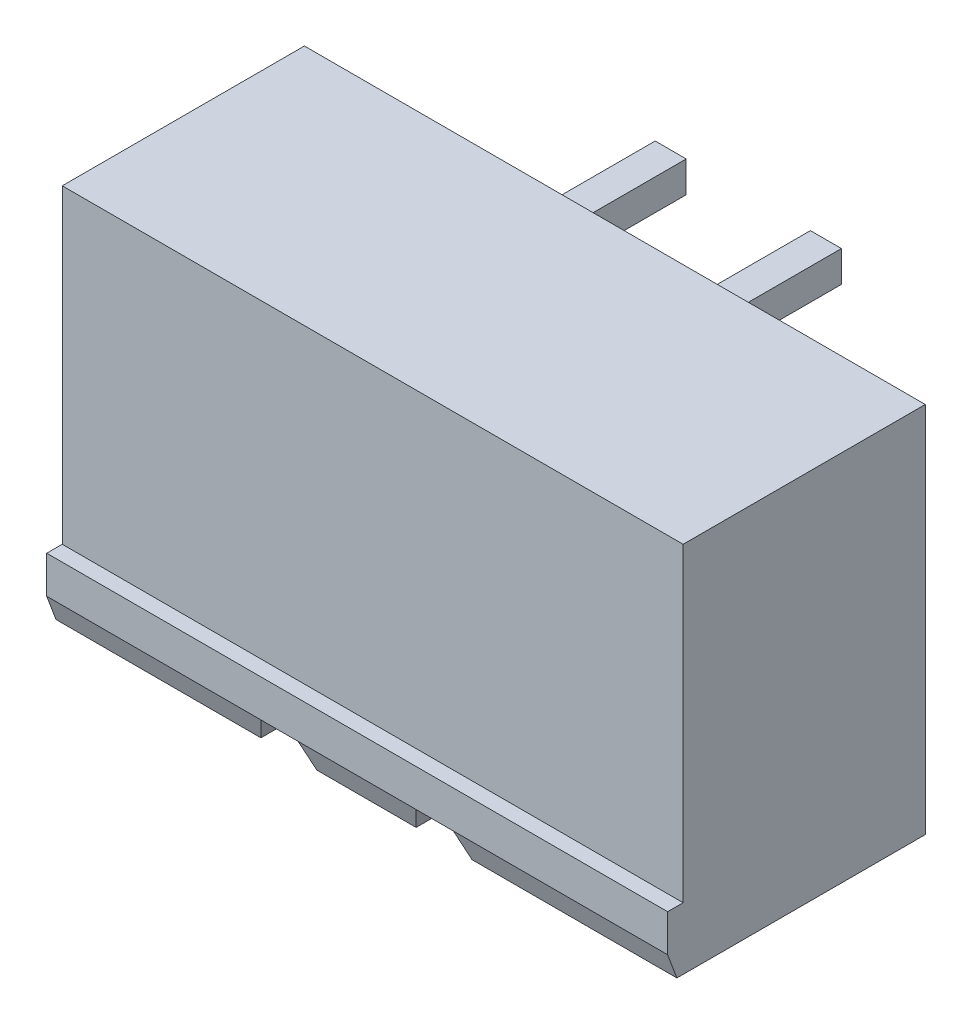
from build123d import *

# Parameters (mm, degrees)
SKETCH_1_W                         = 20
SKETCH_1_H                         = 8.3
EXTRUDE_1_DEPTH                    = 12
HOLE_WIZARD_M2_6_1_D               = 2.05
HOLE_WIZARD_M2_6_1_DEPTH           = 6.55
HOLE_WIZARD_M2_6_1_TIP             = 0.615882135
CUT_EXTRUDE_2_DEPTH                = 8
SKETCH_21_R                        = 1.5
EXTRUDE_2_DEPTH                    = 1.5
EXTRUDE_START                      = 2.5
EXTRUDE_1_2_DEPTH                  = 0.5
CHAMFER_3_SIZE                     = 0.2
PATTERN_LINEAR_1_COUNT             = 2
PATTERN_LINEAR_1_PITCH             = 5
CHAMFER_3_OF_PATTERN_LINEAR_1_SIZE = 0.2
SKETCH_7_W                         = 20
SKETCH_7_H                         = 10
CUT_EXTRUDE_4_DEPTH                = 0.5
CUT_EXTRUDE_7_DEPTH                = 25.824383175
CUT_EXTRUDE_8_REACH                = 22.195
MOVE_BODY_1_ANGLE                  = 90


with BuildPart() as part:
    # Sketch 1 → Extrude 1 (new body)
    with BuildSketch(Plane.XY):
        with Locations((0, 0.15)):
            Rectangle(SKETCH_1_W, SKETCH_1_H)
    extrude(amount=EXTRUDE_1_DEPTH)

    # Hole Wizard M2.6 _1
    with Locations(Plane.XY.offset(12)):
        with Locations((-7.5, 0), (7.5, 0)):
            Hole(HOLE_WIZARD_M2_6_1_D / 2, depth=HOLE_WIZARD_M2_6_1_DEPTH)
            with Locations((0, 0, -(HOLE_WIZARD_M2_6_1_DEPTH + HOLE_WIZARD_M2_6_1_TIP / 2))):  # 118° drill point
                Cone(0, HOLE_WIZARD_M2_6_1_D / 2, HOLE_WIZARD_M2_6_1_TIP, mode=Mode.SUBTRACT)

    # Sketch 3 → Cut-Extrude 2 (cut)
    with BuildSketch(Plane.XY.offset(12)):
        with BuildLine():
            Line((-5, 3), (5, 3))
            Line((5, 3), (5, -2.4))
            Line((5, -2.4), (4.124807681, -2.4))
            ThreePointArc((4.124807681, -2.4), (2.5, -3), (0.875192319, -2.4))
            Line((0.875192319, -2.4), (-0.875192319, -2.4))
            ThreePointArc((-0.875192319, -2.4), (-2.5, -3), (-4.124807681, -2.4))
            Line((-4.124807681, -2.4), (-5, -2.4))
            Line((-5, -2.4), (-5, 3))
        make_face()
    extrude(amount=-CUT_EXTRUDE_2_DEPTH, mode=Mode.SUBTRACT)

    # Sketch 21 → Extrude 2 (add)
    with BuildSketch(Plane.XY.offset(4)):
        with Locations((-2.5, 0)):
            Circle(SKETCH_21_R)
        with Locations(Location((2.5, 0, 0), (0, 0, 180))):
            Circle(SKETCH_21_R)
    extrude(amount=EXTRUDE_2_DEPTH)

    # Sketch 17 → Extrude 1 2 (add, symmetric)
    with BuildSketch(Plane(origin=(0, 0, 0), x_dir=(0, 0, -1), z_dir=(1, 0, 0)).offset(EXTRUDE_START)):
        with BuildLine():
            ThreePointArc((-2.1, 0.5), (-1.534314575, 0.265685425), (-1.3, -0.3))
            Line((-1.3, -0.3), (-1.3, -8.5))
            Line((-1.3, -8.5), (-2.3, -8.5))
            Line((-2.3, -8.5), (-2.3, -0.5))
            Line((-2.3, -0.5), (-11, -0.5))
            Line((-11, -0.5), (-11, 0.5))
            Line((-11, 0.5), (-2.1, 0.5))
        make_face()
    extrude_1_2 = extrude(amount=EXTRUDE_1_2_DEPTH, both=True)

    # Chamfer 3
    chamfer_3_edges = [part.edges().sort_by_distance(p)[0] for p in [
        (2.5, -8.5, 1.3),
        (2.5, -0.5, 11),
        (3, 0, 11),
        (2, -8.5, 1.8),
        (2, 0, 11),
        (2.5, 0.5, 11),
        (3, -8.5, 1.8),
        (2.5, -8.5, 2.3),
    ]]
    chamfer(chamfer_3_edges, length=CHAMFER_3_SIZE)

    # Pattern Linear 1: Extrude 1 2 ×2
    with Locations(*[(-i * PATTERN_LINEAR_1_PITCH, 0, 0) for i in range(1, PATTERN_LINEAR_1_COUNT)]):
        add(extrude_1_2)

    # Chamfer 3 of Pattern Linear 1
    chamfer_3_of_pattern_linear_1_edges = [part.edges().sort_by_distance(p)[0] for p in [
        (-2.5, -8.5, 1.3),
        (-2.5, -0.5, 11),
        (-2, 0, 11),
        (-3, -8.5, 1.8),
        (-3, 0, 11),
        (-2.5, 0.5, 11),
        (-2, -8.5, 1.8),
        (-2.5, -8.5, 2.3),
    ]]
    chamfer(chamfer_3_of_pattern_linear_1_edges, length=CHAMFER_3_OF_PATTERN_LINEAR_1_SIZE)

    # Sketch 7 → Cut-Extrude 4 (cut)
    with BuildSketch(Plane(origin=(0, 4.3, 0), x_dir=(1, 0, 0), z_dir=(0, 1, 0))):
        with Locations((0, -5)):
            Rectangle(SKETCH_7_W, SKETCH_7_H)
    extrude(amount=-CUT_EXTRUDE_4_DEPTH, mode=Mode.SUBTRACT)

    # Sketch 18 → Cut-Extrude 7 (cut, through all)
    with BuildSketch(Plane.ZY.offset(10)):
        Polygon((11.2, 4.3), (12, 4), (12, 4.3), align=None)
    extrude(amount=-CUT_EXTRUDE_7_DEPTH, mode=Mode.SUBTRACT)

    # Cut-Extrude 8: up to this face of the body (flat: up to its plane)
    cut_extrude_8_end = Plane(part.part.faces().sort_by_distance((0, 3, 8))[0])
    # Sketch 20 → Cut-Extrude 8 (cut, up to the picked face)
    with BuildSketch(Plane(origin=(0, 4.3, 0), x_dir=(1, 0, 0), z_dir=(0, 1, 0)), mode=Mode.PRIVATE) as cut_extrude_8_sk1:
        Polygon((3.4, -12), (3.1, -11.2), (1.9, -11.2), (1.6, -12), align=None)
    cut_extrude_8_tool1 = split(extrude(cut_extrude_8_sk1.sketch, amount=-CUT_EXTRUDE_8_REACH, mode=Mode.PRIVATE), bisect_by=cut_extrude_8_end, keep=Keep.BOTH, mode=Mode.PRIVATE)
    # Sketch 20 → Cut-Extrude 8 (cut, up to the picked face)
    with BuildSketch(Plane(origin=(0, 4.3, 0), x_dir=(1, 0, 0), z_dir=(0, 1, 0)), mode=Mode.PRIVATE) as cut_extrude_8_sk2:
        Polygon((-3.1, -11.2), (-1.9, -11.2), (-1.6, -12), (-3.4, -12), align=None)
    cut_extrude_8_tool2 = split(extrude(cut_extrude_8_sk2.sketch, amount=-CUT_EXTRUDE_8_REACH, mode=Mode.PRIVATE), bisect_by=cut_extrude_8_end, keep=Keep.BOTH, mode=Mode.PRIVATE)
    add(cut_extrude_8_tool1.solids().sort_by(Axis((2.5, 4.3, 11.626667), (0, -1, 0)))[0], mode=Mode.SUBTRACT)
    add(cut_extrude_8_tool2.solids().sort_by(Axis((-2.5, 4.3, 11.626667), (0, -1, 0)))[0], mode=Mode.SUBTRACT)


with BuildPart() as part_1:
    # Move Body 1: moved
    add(part.part.rotate(Axis((0, 0, 0), (1, 0, 0)), MOVE_BODY_1_ANGLE))


with BuildPart() as part_2:
    # Move Body 2: moved
    add(part_1.part.moved(Location((2.5, 1.8, 0))))


with BuildPart() as part_3:
    # Move Body 3: moved
    add(part_2.part.moved(Location((0, 0, 4))))


solid = part_3.part
